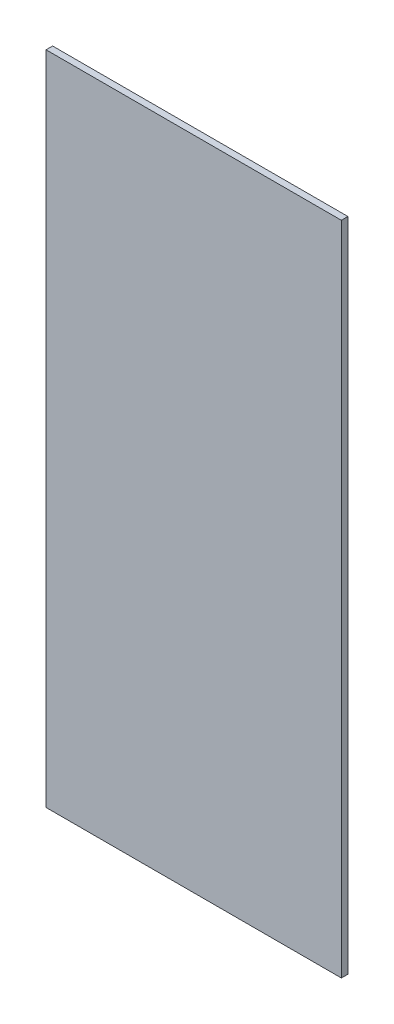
ISO-10303-21;
HEADER;
FILE_DESCRIPTION(('STEP AP214'),'2;1');
FILE_NAME('part.step','',(''),(''),'','','');
FILE_SCHEMA(('AUTOMOTIVE_DESIGN { 1 0 10303 214 1 1 1 1 }'));
ENDSEC;
DATA;
#1=APPLICATION_CONTEXT('core data for automotive mechanical design processes');
#2=APPLICATION_PROTOCOL_DEFINITION('international standard','automotive_design',2000,#1);
#3=PRODUCT_CONTEXT('',#1,'mechanical');
#4=PRODUCT('Part','Part','',(#3));
#5=PRODUCT_RELATED_PRODUCT_CATEGORY('part','',(#4));
#6=PRODUCT_DEFINITION_FORMATION('','',#4);
#7=PRODUCT_DEFINITION_CONTEXT('part definition',#1,'design');
#8=PRODUCT_DEFINITION('design','',#6,#7);
#9=PRODUCT_DEFINITION_SHAPE('','',#8);
#10=(LENGTH_UNIT() NAMED_UNIT(*) SI_UNIT(.MILLI.,.METRE.));
#11=(NAMED_UNIT(*) PLANE_ANGLE_UNIT() SI_UNIT($,.RADIAN.));
#12=(NAMED_UNIT(*) SI_UNIT($,.STERADIAN.) SOLID_ANGLE_UNIT());
#13=UNCERTAINTY_MEASURE_WITH_UNIT(LENGTH_MEASURE(1.E-05),#10,'distance_accuracy_value','');
#14=(GEOMETRIC_REPRESENTATION_CONTEXT(3) GLOBAL_UNCERTAINTY_ASSIGNED_CONTEXT((#13)) GLOBAL_UNIT_ASSIGNED_CONTEXT((#10,
#11,#12)) REPRESENTATION_CONTEXT('',''));
#15=CARTESIAN_POINT('',(0.,0.,0.));
#16=DIRECTION('',(0.,0.,1.));
#17=DIRECTION('',(1.,0.,0.));
#18=AXIS2_PLACEMENT_3D('',#15,#16,#17);
#19=CARTESIAN_POINT('',(0.,0.,20.));
#20=DIRECTION('',(1.,0.,0.));
#21=DIRECTION('',(0.,0.,-1.));
#22=AXIS2_PLACEMENT_3D('',#19,#20,#21);
#23=PLANE('',#22);
#24=DIRECTION('',(0.,-1.,0.));
#25=VECTOR('',#24,1.);
#26=CARTESIAN_POINT('',(0.,0.,0.));
#27=LINE('',#26,#25);
#28=CARTESIAN_POINT('',(0.,2000.,0.));
#29=VERTEX_POINT('',#28);
#30=CARTESIAN_POINT('',(0.,0.,0.));
#31=VERTEX_POINT('',#30);
#32=EDGE_CURVE('E76',#29,#31,#27,.T.);
#33=ORIENTED_EDGE('',*,*,#32,.T.);
#34=DIRECTION('',(0.,0.,-1.));
#35=VECTOR('',#34,1.);
#36=CARTESIAN_POINT('',(0.,0.,20.));
#37=LINE('',#36,#35);
#38=CARTESIAN_POINT('',(0.,0.,20.));
#39=VERTEX_POINT('',#38);
#40=EDGE_CURVE('E11',#39,#31,#37,.T.);
#41=ORIENTED_EDGE('',*,*,#40,.F.);
#42=DIRECTION('',(0.,-1.,0.));
#43=VECTOR('',#42,1.);
#44=CARTESIAN_POINT('',(0.,0.,20.));
#45=LINE('',#44,#43);
#46=CARTESIAN_POINT('',(0.,2000.,20.));
#47=VERTEX_POINT('',#46);
#48=EDGE_CURVE('E94',#47,#39,#45,.T.);
#49=ORIENTED_EDGE('',*,*,#48,.F.);
#50=DIRECTION('',(0.,0.,-1.));
#51=VECTOR('',#50,1.);
#52=CARTESIAN_POINT('',(0.,2000.,20.));
#53=LINE('',#52,#51);
#54=EDGE_CURVE('E88',#47,#29,#53,.T.);
#55=ORIENTED_EDGE('',*,*,#54,.T.);
#56=EDGE_LOOP('',(#33,#41,#49,#55));
#57=FACE_BOUND('',#56,.T.);
#58=ADVANCED_FACE('F32',(#57),#23,.F.);
#59=CARTESIAN_POINT('',(0.,0.,20.));
#60=DIRECTION('',(0.,1.,0.));
#61=DIRECTION('',(0.,0.,1.));
#62=AXIS2_PLACEMENT_3D('',#59,#60,#61);
#63=PLANE('',#62);
#64=DIRECTION('',(1.,0.,0.));
#65=VECTOR('',#64,1.);
#66=CARTESIAN_POINT('',(0.,0.,0.));
#67=LINE('',#66,#65);
#68=CARTESIAN_POINT('',(900.,0.,0.));
#69=VERTEX_POINT('',#68);
#70=EDGE_CURVE('E72',#31,#69,#67,.T.);
#71=ORIENTED_EDGE('',*,*,#70,.T.);
#72=DIRECTION('',(0.,0.,-1.));
#73=VECTOR('',#72,1.);
#74=CARTESIAN_POINT('',(900.,0.,20.));
#75=LINE('',#74,#73);
#76=CARTESIAN_POINT('',(900.,0.,20.));
#77=VERTEX_POINT('',#76);
#78=EDGE_CURVE('E39',#77,#69,#75,.T.);
#79=ORIENTED_EDGE('',*,*,#78,.F.);
#80=DIRECTION('',(1.,0.,0.));
#81=VECTOR('',#80,1.);
#82=CARTESIAN_POINT('',(0.,0.,20.));
#83=LINE('',#82,#81);
#84=EDGE_CURVE('E84',#39,#77,#83,.T.);
#85=ORIENTED_EDGE('',*,*,#84,.F.);
#86=ORIENTED_EDGE('',*,*,#40,.T.);
#87=EDGE_LOOP('',(#71,#79,#85,#86));
#88=FACE_BOUND('',#87,.T.);
#89=ADVANCED_FACE('F83',(#88),#63,.F.);
#90=CARTESIAN_POINT('',(900.,0.,20.));
#91=DIRECTION('',(-1.,0.,0.));
#92=DIRECTION('',(0.,0.,1.));
#93=AXIS2_PLACEMENT_3D('',#90,#91,#92);
#94=PLANE('',#93);
#95=DIRECTION('',(0.,1.,0.));
#96=VECTOR('',#95,1.);
#97=CARTESIAN_POINT('',(900.,0.,0.));
#98=LINE('',#97,#96);
#99=CARTESIAN_POINT('',(900.,2000.,0.));
#100=VERTEX_POINT('',#99);
#101=EDGE_CURVE('E77',#69,#100,#98,.T.);
#102=ORIENTED_EDGE('',*,*,#101,.T.);
#103=DIRECTION('',(0.,0.,-1.));
#104=VECTOR('',#103,1.);
#105=CARTESIAN_POINT('',(900.,2000.,20.));
#106=LINE('',#105,#104);
#107=CARTESIAN_POINT('',(900.,2000.,20.));
#108=VERTEX_POINT('',#107);
#109=EDGE_CURVE('E100',#108,#100,#106,.T.);
#110=ORIENTED_EDGE('',*,*,#109,.F.);
#111=DIRECTION('',(0.,1.,0.));
#112=VECTOR('',#111,1.);
#113=CARTESIAN_POINT('',(900.,0.,20.));
#114=LINE('',#113,#112);
#115=EDGE_CURVE('E51',#77,#108,#114,.T.);
#116=ORIENTED_EDGE('',*,*,#115,.F.);
#117=ORIENTED_EDGE('',*,*,#78,.T.);
#118=EDGE_LOOP('',(#102,#110,#116,#117));
#119=FACE_BOUND('',#118,.T.);
#120=ADVANCED_FACE('F103',(#119),#94,.F.);
#121=CARTESIAN_POINT('',(0.,2000.,20.));
#122=DIRECTION('',(0.,-1.,0.));
#123=DIRECTION('',(0.,0.,-1.));
#124=AXIS2_PLACEMENT_3D('',#121,#122,#123);
#125=PLANE('',#124);
#126=DIRECTION('',(-1.,0.,0.));
#127=VECTOR('',#126,1.);
#128=CARTESIAN_POINT('',(0.,2000.,0.));
#129=LINE('',#128,#127);
#130=EDGE_CURVE('E92',#100,#29,#129,.T.);
#131=ORIENTED_EDGE('',*,*,#130,.T.);
#132=ORIENTED_EDGE('',*,*,#54,.F.);
#133=DIRECTION('',(-1.,0.,0.));
#134=VECTOR('',#133,1.);
#135=CARTESIAN_POINT('',(0.,2000.,20.));
#136=LINE('',#135,#134);
#137=EDGE_CURVE('E46',#108,#47,#136,.T.);
#138=ORIENTED_EDGE('',*,*,#137,.F.);
#139=ORIENTED_EDGE('',*,*,#109,.T.);
#140=EDGE_LOOP('',(#131,#132,#138,#139));
#141=FACE_BOUND('',#140,.T.);
#142=ADVANCED_FACE('F105',(#141),#125,.F.);
#143=CARTESIAN_POINT('',(0.,2000.,20.));
#144=DIRECTION('',(0.,0.,-1.));
#145=DIRECTION('',(-1.,0.,0.));
#146=AXIS2_PLACEMENT_3D('',#143,#144,#145);
#147=PLANE('',#146);
#148=ORIENTED_EDGE('',*,*,#48,.T.);
#149=ORIENTED_EDGE('',*,*,#84,.T.);
#150=ORIENTED_EDGE('',*,*,#115,.T.);
#151=ORIENTED_EDGE('',*,*,#137,.T.);
#152=EDGE_LOOP('',(#148,#149,#150,#151));
#153=FACE_BOUND('',#152,.T.);
#154=ADVANCED_FACE('F106',(#153),#147,.F.);
#155=CARTESIAN_POINT('',(0.,2000.,0.));
#156=DIRECTION('',(0.,0.,-1.));
#157=DIRECTION('',(-1.,0.,0.));
#158=AXIS2_PLACEMENT_3D('',#155,#156,#157);
#159=PLANE('',#158);
#160=ORIENTED_EDGE('',*,*,#32,.F.);
#161=ORIENTED_EDGE('',*,*,#130,.F.);
#162=ORIENTED_EDGE('',*,*,#101,.F.);
#163=ORIENTED_EDGE('',*,*,#70,.F.);
#164=EDGE_LOOP('',(#160,#161,#162,#163));
#165=FACE_BOUND('',#164,.T.);
#166=ADVANCED_FACE('F73',(#165),#159,.T.);
#167=CLOSED_SHELL('',(#58,#89,#120,#142,#154,#166));
#168=MANIFOLD_SOLID_BREP('B2',#167);
#169=ADVANCED_BREP_SHAPE_REPRESENTATION('',(#18,#168),#14);
#170=SHAPE_DEFINITION_REPRESENTATION(#9,#169);
ENDSEC;
END-ISO-10303-21;
